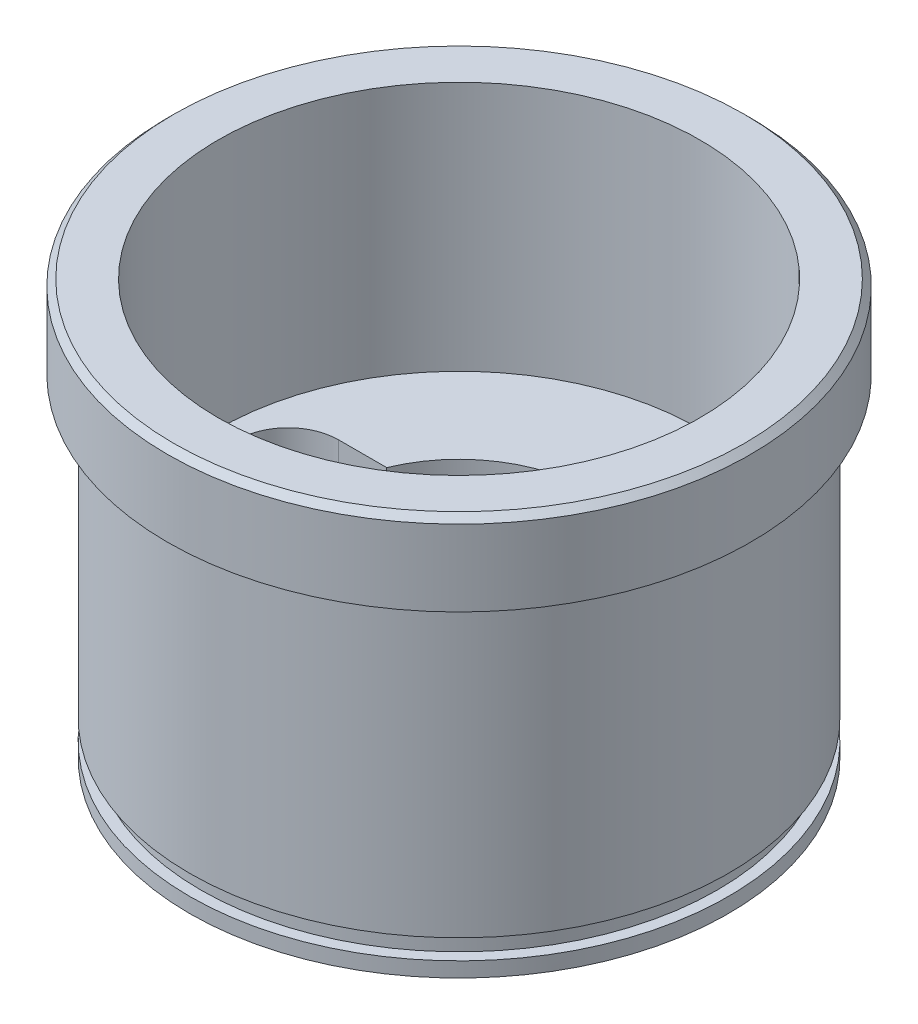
ISO-10303-21;
HEADER;
FILE_DESCRIPTION(('STEP AP214'),'2;1');
FILE_NAME('part.step','',(''),(''),'','','');
FILE_SCHEMA(('AUTOMOTIVE_DESIGN { 1 0 10303 214 1 1 1 1 }'));
ENDSEC;
DATA;
#1=APPLICATION_CONTEXT('core data for automotive mechanical design processes');
#2=APPLICATION_PROTOCOL_DEFINITION('international standard','automotive_design',2000,#1);
#3=PRODUCT_CONTEXT('',#1,'mechanical');
#4=PRODUCT('Part','Part','',(#3));
#5=PRODUCT_RELATED_PRODUCT_CATEGORY('part','',(#4));
#6=PRODUCT_DEFINITION_FORMATION('','',#4);
#7=PRODUCT_DEFINITION_CONTEXT('part definition',#1,'design');
#8=PRODUCT_DEFINITION('design','',#6,#7);
#9=PRODUCT_DEFINITION_SHAPE('','',#8);
#10=(LENGTH_UNIT() NAMED_UNIT(*) SI_UNIT(.MILLI.,.METRE.));
#11=(NAMED_UNIT(*) PLANE_ANGLE_UNIT() SI_UNIT($,.RADIAN.));
#12=(NAMED_UNIT(*) SI_UNIT($,.STERADIAN.) SOLID_ANGLE_UNIT());
#13=UNCERTAINTY_MEASURE_WITH_UNIT(LENGTH_MEASURE(1.E-05),#10,'distance_accuracy_value','');
#14=(GEOMETRIC_REPRESENTATION_CONTEXT(3) GLOBAL_UNCERTAINTY_ASSIGNED_CONTEXT((#13)) GLOBAL_UNIT_ASSIGNED_CONTEXT((#10,
#11,#12)) REPRESENTATION_CONTEXT('',''));
#15=CARTESIAN_POINT('',(0.,0.,0.));
#16=DIRECTION('',(0.,0.,1.));
#17=DIRECTION('',(1.,0.,0.));
#18=AXIS2_PLACEMENT_3D('',#15,#16,#17);
#19=CARTESIAN_POINT('',(0.,0.,0.));
#20=DIRECTION('',(0.,1.,0.));
#21=DIRECTION('',(0.,0.,1.));
#22=AXIS2_PLACEMENT_3D('',#19,#20,#21);
#23=CYLINDRICAL_SURFACE('',#22,42.5);
#24=CARTESIAN_POINT('',(0.,2.35000000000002,0.));
#25=DIRECTION('',(0.,-1.,0.));
#26=DIRECTION('',(0.,0.,-1.));
#27=AXIS2_PLACEMENT_3D('',#24,#25,#26);
#28=CIRCLE('',#27,42.5);
#29=CARTESIAN_POINT('',(0.,2.35000000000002,-42.5));
#30=VERTEX_POINT('',#29);
#31=EDGE_CURVE('E210',#30,#30,#28,.F.);
#32=ORIENTED_EDGE('',*,*,#31,.F.);
#33=EDGE_LOOP('',(#32));
#34=FACE_BOUND('',#33,.T.);
#35=CARTESIAN_POINT('',(0.,0.,0.));
#36=DIRECTION('',(0.,1.,0.));
#37=DIRECTION('',(0.,0.,1.));
#38=AXIS2_PLACEMENT_3D('',#35,#36,#37);
#39=CIRCLE('',#38,42.5);
#40=CARTESIAN_POINT('',(0.,0.,42.5));
#41=VERTEX_POINT('',#40);
#42=EDGE_CURVE('E223',#41,#41,#39,.T.);
#43=ORIENTED_EDGE('',*,*,#42,.T.);
#44=EDGE_LOOP('',(#43));
#45=FACE_BOUND('',#44,.T.);
#46=ADVANCED_FACE('F34',(#34,#45),#23,.T.);
#47=CARTESIAN_POINT('',(0.,0.,0.));
#48=DIRECTION('',(0.,1.,0.));
#49=DIRECTION('',(0.,0.,1.));
#50=AXIS2_PLACEMENT_3D('',#47,#48,#49);
#51=CYLINDRICAL_SURFACE('',#50,33.);
#52=CARTESIAN_POINT('',(0.,1.5,0.));
#53=DIRECTION('',(0.,-1.,0.));
#54=DIRECTION('',(0.,0.,-1.));
#55=AXIS2_PLACEMENT_3D('',#52,#53,#54);
#56=CIRCLE('',#55,33.);
#57=CARTESIAN_POINT('',(0.,1.5,-33.));
#58=VERTEX_POINT('',#57);
#59=EDGE_CURVE('E258',#58,#58,#56,.T.);
#60=ORIENTED_EDGE('',*,*,#59,.T.);
#61=EDGE_LOOP('',(#60));
#62=FACE_BOUND('',#61,.T.);
#63=CARTESIAN_POINT('',(0.,5.,0.));
#64=DIRECTION('',(0.,1.,0.));
#65=DIRECTION('',(0.,0.,1.));
#66=AXIS2_PLACEMENT_3D('',#63,#64,#65);
#67=CIRCLE('',#66,33.);
#68=CARTESIAN_POINT('',(0.,5.,33.));
#69=VERTEX_POINT('',#68);
#70=EDGE_CURVE('E224',#69,#69,#67,.T.);
#71=ORIENTED_EDGE('',*,*,#70,.T.);
#72=EDGE_LOOP('',(#71));
#73=FACE_BOUND('',#72,.T.);
#74=ADVANCED_FACE('F318',(#62,#73),#51,.F.);
#75=CARTESIAN_POINT('',(0.,14.,0.));
#76=DIRECTION('',(0.,1.,0.));
#77=DIRECTION('',(0.,0.,1.));
#78=AXIS2_PLACEMENT_3D('',#75,#76,#77);
#79=CIRCLE('',#78,33.);
#80=CARTESIAN_POINT('',(0.,14.,33.));
#81=VERTEX_POINT('',#80);
#82=EDGE_CURVE('E227',#81,#81,#79,.T.);
#83=ORIENTED_EDGE('',*,*,#82,.T.);
#84=EDGE_LOOP('',(#83));
#85=FACE_BOUND('',#84,.T.);
#86=CARTESIAN_POINT('',(0.,9.77,0.));
#87=DIRECTION('',(0.,-1.,0.));
#88=DIRECTION('',(0.,0.,-1.));
#89=AXIS2_PLACEMENT_3D('',#86,#87,#88);
#90=CIRCLE('',#89,33.);
#91=CARTESIAN_POINT('',(0.,9.77,-33.));
#92=VERTEX_POINT('',#91);
#93=EDGE_CURVE('E219',#92,#92,#90,.T.);
#94=ORIENTED_EDGE('',*,*,#93,.T.);
#95=EDGE_LOOP('',(#94));
#96=FACE_BOUND('',#95,.T.);
#97=ADVANCED_FACE('F325',(#85,#96),#51,.F.);
#98=CARTESIAN_POINT('',(-46.,52.5,0.));
#99=DIRECTION('',(0.,-1.,0.));
#100=DIRECTION('',(0.,0.,-1.));
#101=AXIS2_PLACEMENT_3D('',#98,#99,#100);
#102=PLANE('',#101);
#103=CARTESIAN_POINT('',(0.,52.5,0.));
#104=DIRECTION('',(0.,1.,0.));
#105=DIRECTION('',(0.,0.,1.));
#106=AXIS2_PLACEMENT_3D('',#103,#104,#105);
#107=CIRCLE('',#106,42.5);
#108=CARTESIAN_POINT('',(0.,52.5,42.5));
#109=VERTEX_POINT('',#108);
#110=EDGE_CURVE('E220',#109,#109,#107,.T.);
#111=ORIENTED_EDGE('',*,*,#110,.T.);
#112=EDGE_LOOP('',(#111));
#113=FACE_BOUND('',#112,.T.);
#114=CARTESIAN_POINT('',(0.,52.5,0.));
#115=DIRECTION('',(0.,1.,0.));
#116=DIRECTION('',(0.,0.,1.));
#117=AXIS2_PLACEMENT_3D('',#114,#115,#116);
#118=CIRCLE('',#117,46.);
#119=CARTESIAN_POINT('',(0.,52.5,46.));
#120=VERTEX_POINT('',#119);
#121=EDGE_CURVE('E240',#120,#120,#118,.T.);
#122=ORIENTED_EDGE('',*,*,#121,.F.);
#123=EDGE_LOOP('',(#122));
#124=FACE_BOUND('',#123,.T.);
#125=ADVANCED_FACE('F36',(#113,#124),#102,.T.);
#126=CARTESIAN_POINT('',(0.,0.,0.));
#127=DIRECTION('',(0.,1.,0.));
#128=DIRECTION('',(0.,0.,1.));
#129=AXIS2_PLACEMENT_3D('',#126,#127,#128);
#130=CYLINDRICAL_SURFACE('',#129,46.);
#131=CARTESIAN_POINT('',(0.,64.5,0.));
#132=DIRECTION('',(0.,1.,0.));
#133=DIRECTION('',(0.,0.,1.));
#134=AXIS2_PLACEMENT_3D('',#131,#132,#133);
#135=CIRCLE('',#134,46.);
#136=CARTESIAN_POINT('',(0.,64.5,46.));
#137=VERTEX_POINT('',#136);
#138=EDGE_CURVE('E246',#137,#137,#135,.F.);
#139=ORIENTED_EDGE('',*,*,#138,.T.);
#140=EDGE_LOOP('',(#139));
#141=FACE_BOUND('',#140,.T.);
#142=ORIENTED_EDGE('',*,*,#121,.T.);
#143=EDGE_LOOP('',(#142));
#144=FACE_BOUND('',#143,.T.);
#145=ADVANCED_FACE('F350',(#141,#144),#130,.T.);
#146=CARTESIAN_POINT('',(-38.,65.5,0.));
#147=DIRECTION('',(0.,1.,0.));
#148=DIRECTION('',(0.,0.,1.));
#149=AXIS2_PLACEMENT_3D('',#146,#147,#148);
#150=PLANE('',#149);
#151=CARTESIAN_POINT('',(0.,65.5,0.));
#152=DIRECTION('',(0.,1.,0.));
#153=DIRECTION('',(0.,0.,1.));
#154=AXIS2_PLACEMENT_3D('',#151,#152,#153);
#155=CIRCLE('',#154,45.);
#156=CARTESIAN_POINT('',(0.,65.5,45.));
#157=VERTEX_POINT('',#156);
#158=EDGE_CURVE('E243',#157,#157,#155,.T.);
#159=ORIENTED_EDGE('',*,*,#158,.T.);
#160=EDGE_LOOP('',(#159));
#161=FACE_BOUND('',#160,.T.);
#162=CARTESIAN_POINT('',(0.,65.5,0.));
#163=DIRECTION('',(0.,1.,0.));
#164=DIRECTION('',(0.,0.,1.));
#165=AXIS2_PLACEMENT_3D('',#162,#163,#164);
#166=CIRCLE('',#165,38.);
#167=CARTESIAN_POINT('',(0.,65.5,38.));
#168=VERTEX_POINT('',#167);
#169=EDGE_CURVE('E237',#168,#168,#166,.T.);
#170=ORIENTED_EDGE('',*,*,#169,.F.);
#171=EDGE_LOOP('',(#170));
#172=FACE_BOUND('',#171,.T.);
#173=ADVANCED_FACE('F354',(#161,#172),#150,.T.);
#174=CARTESIAN_POINT('',(0.,0.,0.));
#175=DIRECTION('',(0.,1.,0.));
#176=DIRECTION('',(0.,0.,1.));
#177=AXIS2_PLACEMENT_3D('',#174,#175,#176);
#178=CYLINDRICAL_SURFACE('',#177,38.);
#179=ORIENTED_EDGE('',*,*,#169,.T.);
#180=EDGE_LOOP('',(#179));
#181=FACE_BOUND('',#180,.T.);
#182=CARTESIAN_POINT('',(0.,26.,0.));
#183=DIRECTION('',(0.,1.,0.));
#184=DIRECTION('',(0.,0.,1.));
#185=AXIS2_PLACEMENT_3D('',#182,#183,#184);
#186=CIRCLE('',#185,38.);
#187=CARTESIAN_POINT('',(0.,26.,38.));
#188=VERTEX_POINT('',#187);
#189=EDGE_CURVE('E233',#188,#188,#186,.T.);
#190=ORIENTED_EDGE('',*,*,#189,.F.);
#191=EDGE_LOOP('',(#190));
#192=FACE_BOUND('',#191,.T.);
#193=ADVANCED_FACE('F359',(#181,#192),#178,.F.);
#194=CARTESIAN_POINT('',(-21.,26.,0.));
#195=DIRECTION('',(0.,1.,0.));
#196=DIRECTION('',(0.,0.,1.));
#197=AXIS2_PLACEMENT_3D('',#194,#195,#196);
#198=PLANE('',#197);
#199=DIRECTION('',(0.500000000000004,0.,0.866025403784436));
#200=VECTOR('',#199,1.);
#201=CARTESIAN_POINT('',(6.57179676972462,26.,27.3826859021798));
#202=LINE('',#201,#200);
#203=CARTESIAN_POINT('',(2.78004068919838,26.,20.8151717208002));
#204=VERTEX_POINT('',#203);
#205=CARTESIAN_POINT('',(6.57179676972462,26.,27.3826859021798));
#206=VERTEX_POINT('',#205);
#207=EDGE_CURVE('E162',#204,#206,#202,.T.);
#208=ORIENTED_EDGE('',*,*,#207,.F.);
#209=CARTESIAN_POINT('',(0.,26.,0.));
#210=DIRECTION('',(0.,1.,0.));
#211=DIRECTION('',(0.,0.,1.));
#212=AXIS2_PLACEMENT_3D('',#209,#210,#211);
#213=CIRCLE('',#212,21.);
#214=CARTESIAN_POINT('',(-19.4164878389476,26.,8.));
#215=VERTEX_POINT('',#214);
#216=EDGE_CURVE('E230',#215,#204,#213,.T.);
#217=ORIENTED_EDGE('',*,*,#216,.F.);
#218=DIRECTION('',(1.,0.,0.));
#219=VECTOR('',#218,1.);
#220=CARTESIAN_POINT('',(-27.,26.,8.));
#221=LINE('',#220,#219);
#222=CARTESIAN_POINT('',(-27.,26.,8.));
#223=VERTEX_POINT('',#222);
#224=EDGE_CURVE('E183',#223,#215,#221,.T.);
#225=ORIENTED_EDGE('',*,*,#224,.F.);
#226=CARTESIAN_POINT('',(-27.,26.,0.));
#227=DIRECTION('',(0.,1.,0.));
#228=DIRECTION('',(0.,0.,1.));
#229=AXIS2_PLACEMENT_3D('',#226,#227,#228);
#230=CIRCLE('',#229,8.);
#231=CARTESIAN_POINT('',(-27.,26.,-8.));
#232=VERTEX_POINT('',#231);
#233=EDGE_CURVE('E178',#232,#223,#230,.T.);
#234=ORIENTED_EDGE('',*,*,#233,.F.);
#235=DIRECTION('',(-1.,0.,0.));
#236=VECTOR('',#235,1.);
#237=CARTESIAN_POINT('',(-27.,26.,-8.));
#238=LINE('',#237,#236);
#239=CARTESIAN_POINT('',(-19.4164878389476,26.,-8.));
#240=VERTEX_POINT('',#239);
#241=EDGE_CURVE('E185',#240,#232,#238,.T.);
#242=ORIENTED_EDGE('',*,*,#241,.F.);
#243=CARTESIAN_POINT('',(2.7800406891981,26.,-20.8151717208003));
#244=VERTEX_POINT('',#243);
#245=EDGE_CURVE('E146',#244,#240,#213,.T.);
#246=ORIENTED_EDGE('',*,*,#245,.F.);
#247=DIRECTION('',(-0.499999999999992,0.,0.866025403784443));
#248=VECTOR('',#247,1.);
#249=CARTESIAN_POINT('',(6.57179676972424,26.,-27.3826859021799));
#250=LINE('',#249,#248);
#251=CARTESIAN_POINT('',(6.57179676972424,26.,-27.3826859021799));
#252=VERTEX_POINT('',#251);
#253=EDGE_CURVE('E57',#252,#244,#250,.T.);
#254=ORIENTED_EDGE('',*,*,#253,.F.);
#255=CARTESIAN_POINT('',(13.4999999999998,26.,-23.38268590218));
#256=DIRECTION('',(0.,1.,0.));
#257=DIRECTION('',(-0.866025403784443,0.,-0.499999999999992));
#258=AXIS2_PLACEMENT_3D('',#255,#256,#257);
#259=CIRCLE('',#258,8.);
#260=CARTESIAN_POINT('',(20.4282032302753,26.,-19.38268590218));
#261=VERTEX_POINT('',#260);
#262=EDGE_CURVE('E134',#261,#252,#259,.T.);
#263=ORIENTED_EDGE('',*,*,#262,.F.);
#264=DIRECTION('',(0.499999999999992,0.,-0.866025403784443));
#265=VECTOR('',#264,1.);
#266=CARTESIAN_POINT('',(20.4282032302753,26.,-19.38268590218));
#267=LINE('',#266,#265);
#268=CARTESIAN_POINT('',(16.6364471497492,26.,-12.8151717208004));
#269=VERTEX_POINT('',#268);
#270=EDGE_CURVE('E147',#269,#261,#267,.T.);
#271=ORIENTED_EDGE('',*,*,#270,.F.);
#272=CARTESIAN_POINT('',(16.6364471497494,26.,12.8151717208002));
#273=VERTEX_POINT('',#272);
#274=EDGE_CURVE('E234',#273,#269,#213,.T.);
#275=ORIENTED_EDGE('',*,*,#274,.F.);
#276=DIRECTION('',(-0.500000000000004,0.,-0.866025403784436));
#277=VECTOR('',#276,1.);
#278=CARTESIAN_POINT('',(20.4282032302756,26.,19.3826859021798));
#279=LINE('',#278,#277);
#280=CARTESIAN_POINT('',(20.4282032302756,26.,19.3826859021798));
#281=VERTEX_POINT('',#280);
#282=EDGE_CURVE('E160',#281,#273,#279,.T.);
#283=ORIENTED_EDGE('',*,*,#282,.F.);
#284=CARTESIAN_POINT('',(13.5000000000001,26.,23.3826859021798));
#285=DIRECTION('',(0.,1.,0.));
#286=DIRECTION('',(0.866025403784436,0.,-0.500000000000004));
#287=AXIS2_PLACEMENT_3D('',#284,#285,#286);
#288=CIRCLE('',#287,8.);
#289=EDGE_CURVE('E156',#206,#281,#288,.T.);
#290=ORIENTED_EDGE('',*,*,#289,.F.);
#291=EDGE_LOOP('',(#208,#217,#225,#234,#242,#246,#254,#263,#271,#275,#283,#290));
#292=FACE_BOUND('',#291,.T.);
#293=ORIENTED_EDGE('',*,*,#189,.T.);
#294=EDGE_LOOP('',(#293));
#295=FACE_BOUND('',#294,.T.);
#296=ADVANCED_FACE('F143',(#292,#295),#198,.T.);
#297=CARTESIAN_POINT('',(0.,0.,0.));
#298=DIRECTION('',(0.,1.,0.));
#299=DIRECTION('',(0.,0.,1.));
#300=AXIS2_PLACEMENT_3D('',#297,#298,#299);
#301=CYLINDRICAL_SURFACE('',#300,21.);
#302=DIRECTION('',(0.,1.,0.));
#303=VECTOR('',#302,1.);
#304=CARTESIAN_POINT('',(2.78004068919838,0.,20.8151717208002));
#305=LINE('',#304,#303);
#306=CARTESIAN_POINT('',(2.78004068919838,19.,20.8151717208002));
#307=VERTEX_POINT('',#306);
#308=EDGE_CURVE('E11',#307,#204,#305,.T.);
#309=ORIENTED_EDGE('',*,*,#308,.F.);
#310=CARTESIAN_POINT('',(0.,19.,0.));
#311=DIRECTION('',(0.,1.,0.));
#312=DIRECTION('',(0.,0.,1.));
#313=AXIS2_PLACEMENT_3D('',#310,#311,#312);
#314=CIRCLE('',#313,21.);
#315=CARTESIAN_POINT('',(16.6364471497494,19.,12.8151717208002));
#316=VERTEX_POINT('',#315);
#317=EDGE_CURVE('E284',#307,#316,#314,.T.);
#318=ORIENTED_EDGE('',*,*,#317,.T.);
#319=DIRECTION('',(0.,1.,0.));
#320=VECTOR('',#319,1.);
#321=CARTESIAN_POINT('',(16.6364471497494,0.,12.8151717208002));
#322=LINE('',#321,#320);
#323=EDGE_CURVE('E42',#273,#316,#322,.F.);
#324=ORIENTED_EDGE('',*,*,#323,.F.);
#325=ORIENTED_EDGE('',*,*,#274,.T.);
#326=DIRECTION('',(0.,1.,0.));
#327=VECTOR('',#326,1.);
#328=CARTESIAN_POINT('',(16.6364471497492,0.,-12.8151717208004));
#329=LINE('',#328,#327);
#330=CARTESIAN_POINT('',(16.6364471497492,19.,-12.8151717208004));
#331=VERTEX_POINT('',#330);
#332=EDGE_CURVE('E283',#331,#269,#329,.T.);
#333=ORIENTED_EDGE('',*,*,#332,.F.);
#334=CARTESIAN_POINT('',(2.7800406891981,19.,-20.8151717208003));
#335=VERTEX_POINT('',#334);
#336=EDGE_CURVE('E280',#331,#335,#314,.T.);
#337=ORIENTED_EDGE('',*,*,#336,.T.);
#338=DIRECTION('',(0.,1.,0.));
#339=VECTOR('',#338,1.);
#340=CARTESIAN_POINT('',(2.7800406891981,0.,-20.8151717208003));
#341=LINE('',#340,#339);
#342=EDGE_CURVE('E278',#244,#335,#341,.F.);
#343=ORIENTED_EDGE('',*,*,#342,.F.);
#344=ORIENTED_EDGE('',*,*,#245,.T.);
#345=DIRECTION('',(0.,1.,0.));
#346=VECTOR('',#345,1.);
#347=CARTESIAN_POINT('',(-19.4164878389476,0.,-8.));
#348=LINE('',#347,#346);
#349=CARTESIAN_POINT('',(-19.4164878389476,19.,-8.));
#350=VERTEX_POINT('',#349);
#351=EDGE_CURVE('E275',#350,#240,#348,.T.);
#352=ORIENTED_EDGE('',*,*,#351,.F.);
#353=CARTESIAN_POINT('',(0.,19.,0.));
#354=DIRECTION('',(0.,1.,0.));
#355=DIRECTION('',(0.,0.,1.));
#356=AXIS2_PLACEMENT_3D('',#353,#354,#355);
#357=CIRCLE('',#356,21.);
#358=CARTESIAN_POINT('',(-19.4164878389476,19.,8.));
#359=VERTEX_POINT('',#358);
#360=EDGE_CURVE('E261',#350,#359,#357,.T.);
#361=ORIENTED_EDGE('',*,*,#360,.T.);
#362=DIRECTION('',(0.,1.,0.));
#363=VECTOR('',#362,1.);
#364=CARTESIAN_POINT('',(-19.4164878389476,0.,8.));
#365=LINE('',#364,#363);
#366=EDGE_CURVE('E272',#215,#359,#365,.F.);
#367=ORIENTED_EDGE('',*,*,#366,.F.);
#368=ORIENTED_EDGE('',*,*,#216,.T.);
#369=EDGE_LOOP('',(#309,#318,#324,#325,#333,#337,#343,#344,#352,#361,#367,#368));
#370=FACE_BOUND('',#369,.T.);
#371=CARTESIAN_POINT('',(0.,15.,0.));
#372=DIRECTION('',(0.,-1.,0.));
#373=DIRECTION('',(0.,0.,-1.));
#374=AXIS2_PLACEMENT_3D('',#371,#372,#373);
#375=CIRCLE('',#374,21.);
#376=CARTESIAN_POINT('',(0.,15.,-21.));
#377=VERTEX_POINT('',#376);
#378=EDGE_CURVE('E252',#377,#377,#375,.T.);
#379=ORIENTED_EDGE('',*,*,#378,.T.);
#380=EDGE_LOOP('',(#379));
#381=FACE_BOUND('',#380,.T.);
#382=ADVANCED_FACE('F290',(#370,#381),#301,.F.);
#383=CARTESIAN_POINT('',(-33.,14.,0.));
#384=DIRECTION('',(0.,-1.,0.));
#385=DIRECTION('',(0.,0.,-1.));
#386=AXIS2_PLACEMENT_3D('',#383,#384,#385);
#387=PLANE('',#386);
#388=CARTESIAN_POINT('',(13.4999999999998,14.,-23.38268590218));
#389=DIRECTION('',(0.,-1.,0.));
#390=DIRECTION('',(0.,0.,-1.));
#391=AXIS2_PLACEMENT_3D('',#388,#389,#390);
#392=CIRCLE('',#391,3.5);
#393=CARTESIAN_POINT('',(13.4999999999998,14.,-26.88268590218));
#394=VERTEX_POINT('',#393);
#395=EDGE_CURVE('E377',#394,#394,#392,.F.);
#396=ORIENTED_EDGE('',*,*,#395,.T.);
#397=EDGE_LOOP('',(#396));
#398=FACE_BOUND('',#397,.T.);
#399=CARTESIAN_POINT('',(13.5000000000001,14.,23.3826859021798));
#400=DIRECTION('',(0.,-1.,0.));
#401=DIRECTION('',(0.,0.,-1.));
#402=AXIS2_PLACEMENT_3D('',#399,#400,#401);
#403=CIRCLE('',#402,3.5);
#404=CARTESIAN_POINT('',(13.5000000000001,14.,19.8826859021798));
#405=VERTEX_POINT('',#404);
#406=EDGE_CURVE('E381',#405,#405,#403,.F.);
#407=ORIENTED_EDGE('',*,*,#406,.T.);
#408=EDGE_LOOP('',(#407));
#409=FACE_BOUND('',#408,.T.);
#410=CARTESIAN_POINT('',(-27.,14.,0.));
#411=DIRECTION('',(0.,-1.,0.));
#412=DIRECTION('',(0.,0.,-1.));
#413=AXIS2_PLACEMENT_3D('',#410,#411,#412);
#414=CIRCLE('',#413,3.5);
#415=CARTESIAN_POINT('',(-27.,14.,-3.5));
#416=VERTEX_POINT('',#415);
#417=EDGE_CURVE('E173',#416,#416,#414,.F.);
#418=ORIENTED_EDGE('',*,*,#417,.T.);
#419=EDGE_LOOP('',(#418));
#420=FACE_BOUND('',#419,.T.);
#421=CARTESIAN_POINT('',(0.,14.,0.));
#422=DIRECTION('',(0.,-1.,0.));
#423=DIRECTION('',(0.,0.,-1.));
#424=AXIS2_PLACEMENT_3D('',#421,#422,#423);
#425=CIRCLE('',#424,22.);
#426=CARTESIAN_POINT('',(0.,14.,-22.));
#427=VERTEX_POINT('',#426);
#428=EDGE_CURVE('E249',#427,#427,#425,.F.);
#429=ORIENTED_EDGE('',*,*,#428,.T.);
#430=EDGE_LOOP('',(#429));
#431=FACE_BOUND('',#430,.T.);
#432=ORIENTED_EDGE('',*,*,#82,.F.);
#433=EDGE_LOOP('',(#432));
#434=FACE_BOUND('',#433,.T.);
#435=ADVANCED_FACE('F342',(#398,#409,#420,#431,#434),#387,.T.);
#436=CARTESIAN_POINT('',(-42.5,0.,0.));
#437=DIRECTION('',(0.,-1.,0.));
#438=DIRECTION('',(0.,0.,-1.));
#439=AXIS2_PLACEMENT_3D('',#436,#437,#438);
#440=PLANE('',#439);
#441=CARTESIAN_POINT('',(0.,0.,0.));
#442=DIRECTION('',(0.,-1.,0.));
#443=DIRECTION('',(0.,0.,-1.));
#444=AXIS2_PLACEMENT_3D('',#441,#442,#443);
#445=CIRCLE('',#444,33.8660254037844);
#446=CARTESIAN_POINT('',(0.,0.,-33.8660254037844));
#447=VERTEX_POINT('',#446);
#448=EDGE_CURVE('E255',#447,#447,#445,.F.);
#449=ORIENTED_EDGE('',*,*,#448,.T.);
#450=EDGE_LOOP('',(#449));
#451=FACE_BOUND('',#450,.T.);
#452=ORIENTED_EDGE('',*,*,#42,.F.);
#453=EDGE_LOOP('',(#452));
#454=FACE_BOUND('',#453,.T.);
#455=ADVANCED_FACE('F334',(#451,#454),#440,.T.);
#456=CARTESIAN_POINT('',(0.,5.50000000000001,0.));
#457=DIRECTION('',(0.,1.,0.));
#458=DIRECTION('',(0.,0.,1.));
#459=AXIS2_PLACEMENT_3D('',#456,#457,#458);
#460=CIRCLE('',#459,42.5);
#461=CARTESIAN_POINT('',(0.,5.50000000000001,42.5));
#462=VERTEX_POINT('',#461);
#463=EDGE_CURVE('E205',#462,#462,#460,.F.);
#464=ORIENTED_EDGE('',*,*,#463,.F.);
#465=EDGE_LOOP('',(#464));
#466=FACE_BOUND('',#465,.T.);
#467=ORIENTED_EDGE('',*,*,#110,.F.);
#468=EDGE_LOOP('',(#467));
#469=FACE_BOUND('',#468,.T.);
#470=ADVANCED_FACE('F321',(#466,#469),#23,.T.);
#471=CARTESIAN_POINT('',(0.,65.5,0.));
#472=DIRECTION('',(0.,-1.,0.));
#473=DIRECTION('',(0.,0.,-1.));
#474=AXIS2_PLACEMENT_3D('',#471,#472,#473);
#475=CONICAL_SURFACE('',#474,45.,0.785398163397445);
#476=ORIENTED_EDGE('',*,*,#138,.F.);
#477=EDGE_LOOP('',(#476));
#478=FACE_BOUND('',#477,.T.);
#479=ORIENTED_EDGE('',*,*,#158,.F.);
#480=EDGE_LOOP('',(#479));
#481=FACE_BOUND('',#480,.T.);
#482=ADVANCED_FACE('F333',(#478,#481),#475,.T.);
#483=CARTESIAN_POINT('',(0.,14.,0.));
#484=DIRECTION('',(0.,-1.,0.));
#485=DIRECTION('',(0.,0.,-1.));
#486=AXIS2_PLACEMENT_3D('',#483,#484,#485);
#487=CONICAL_SURFACE('',#486,22.,0.785398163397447);
#488=ORIENTED_EDGE('',*,*,#378,.F.);
#489=EDGE_LOOP('',(#488));
#490=FACE_BOUND('',#489,.T.);
#491=ORIENTED_EDGE('',*,*,#428,.F.);
#492=EDGE_LOOP('',(#491));
#493=FACE_BOUND('',#492,.T.);
#494=ADVANCED_FACE('F340',(#490,#493),#487,.F.);
#495=CARTESIAN_POINT('',(0.,0.,0.));
#496=DIRECTION('',(0.,-1.,0.));
#497=DIRECTION('',(0.,0.,-1.));
#498=AXIS2_PLACEMENT_3D('',#495,#496,#497);
#499=CONICAL_SURFACE('',#498,33.8660254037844,0.523598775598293);
#500=ORIENTED_EDGE('',*,*,#59,.F.);
#501=EDGE_LOOP('',(#500));
#502=FACE_BOUND('',#501,.T.);
#503=ORIENTED_EDGE('',*,*,#448,.F.);
#504=EDGE_LOOP('',(#503));
#505=FACE_BOUND('',#504,.T.);
#506=ADVANCED_FACE('F418',(#502,#505),#499,.F.);
#507=CARTESIAN_POINT('',(-34.86,5.,0.));
#508=DIRECTION('',(0.,1.,0.));
#509=DIRECTION('',(0.,0.,1.));
#510=AXIS2_PLACEMENT_3D('',#507,#508,#509);
#511=PLANE('',#510);
#512=ORIENTED_EDGE('',*,*,#70,.F.);
#513=EDGE_LOOP('',(#512));
#514=FACE_BOUND('',#513,.T.);
#515=CARTESIAN_POINT('',(0.,5.,0.));
#516=DIRECTION('',(0.,-1.,0.));
#517=DIRECTION('',(0.,0.,-1.));
#518=AXIS2_PLACEMENT_3D('',#515,#516,#517);
#519=CIRCLE('',#518,34.86);
#520=CARTESIAN_POINT('',(0.,5.,-34.86));
#521=VERTEX_POINT('',#520);
#522=EDGE_CURVE('E216',#521,#521,#519,.T.);
#523=ORIENTED_EDGE('',*,*,#522,.F.);
#524=EDGE_LOOP('',(#523));
#525=FACE_BOUND('',#524,.T.);
#526=ADVANCED_FACE('F414',(#514,#525),#511,.T.);
#527=CARTESIAN_POINT('',(0.,6.00000000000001,0.));
#528=DIRECTION('',(0.,-1.,0.));
#529=DIRECTION('',(0.,0.,-1.));
#530=AXIS2_PLACEMENT_3D('',#527,#528,#529);
#531=TOROIDAL_SURFACE('',#530,34.86,1.);
#532=ORIENTED_EDGE('',*,*,#522,.T.);
#533=EDGE_LOOP('',(#532));
#534=FACE_BOUND('',#533,.T.);
#535=CARTESIAN_POINT('',(0.,6.00000000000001,0.));
#536=DIRECTION('',(0.,-1.,0.));
#537=DIRECTION('',(0.,0.,-1.));
#538=AXIS2_PLACEMENT_3D('',#535,#536,#537);
#539=CIRCLE('',#538,35.86);
#540=CARTESIAN_POINT('',(0.,6.00000000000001,-35.86));
#541=VERTEX_POINT('',#540);
#542=EDGE_CURVE('E213',#541,#541,#539,.T.);
#543=ORIENTED_EDGE('',*,*,#542,.F.);
#544=EDGE_LOOP('',(#543));
#545=FACE_BOUND('',#544,.T.);
#546=ADVANCED_FACE('F407',(#534,#545),#531,.F.);
#547=CARTESIAN_POINT('',(0.,0.,0.));
#548=DIRECTION('',(0.,-1.,0.));
#549=DIRECTION('',(0.,0.,-1.));
#550=AXIS2_PLACEMENT_3D('',#547,#548,#549);
#551=CYLINDRICAL_SURFACE('',#550,35.86);
#552=ORIENTED_EDGE('',*,*,#542,.T.);
#553=EDGE_LOOP('',(#552));
#554=FACE_BOUND('',#553,.T.);
#555=CARTESIAN_POINT('',(0.,8.77,0.));
#556=DIRECTION('',(0.,-1.,0.));
#557=DIRECTION('',(0.,0.,-1.));
#558=AXIS2_PLACEMENT_3D('',#555,#556,#557);
#559=CIRCLE('',#558,35.86);
#560=CARTESIAN_POINT('',(0.,8.77,-35.86));
#561=VERTEX_POINT('',#560);
#562=EDGE_CURVE('E209',#561,#561,#559,.T.);
#563=ORIENTED_EDGE('',*,*,#562,.F.);
#564=EDGE_LOOP('',(#563));
#565=FACE_BOUND('',#564,.T.);
#566=ADVANCED_FACE('F401',(#554,#565),#551,.F.);
#567=CARTESIAN_POINT('',(0.,8.77,0.));
#568=DIRECTION('',(0.,-1.,0.));
#569=DIRECTION('',(0.,0.,-1.));
#570=AXIS2_PLACEMENT_3D('',#567,#568,#569);
#571=TOROIDAL_SURFACE('',#570,34.86,1.);
#572=ORIENTED_EDGE('',*,*,#562,.T.);
#573=EDGE_LOOP('',(#572));
#574=FACE_BOUND('',#573,.T.);
#575=CARTESIAN_POINT('',(0.,9.77,0.));
#576=DIRECTION('',(0.,-1.,0.));
#577=DIRECTION('',(0.,0.,-1.));
#578=AXIS2_PLACEMENT_3D('',#575,#576,#577);
#579=CIRCLE('',#578,34.86);
#580=CARTESIAN_POINT('',(0.,9.77,-34.86));
#581=VERTEX_POINT('',#580);
#582=EDGE_CURVE('E206',#581,#581,#579,.T.);
#583=ORIENTED_EDGE('',*,*,#582,.F.);
#584=EDGE_LOOP('',(#583));
#585=FACE_BOUND('',#584,.T.);
#586=ADVANCED_FACE('F396',(#574,#585),#571,.F.);
#587=CARTESIAN_POINT('',(-34.86,9.77,0.));
#588=DIRECTION('',(0.,-1.,0.));
#589=DIRECTION('',(0.,0.,-1.));
#590=AXIS2_PLACEMENT_3D('',#587,#588,#589);
#591=PLANE('',#590);
#592=ORIENTED_EDGE('',*,*,#93,.F.);
#593=EDGE_LOOP('',(#592));
#594=FACE_BOUND('',#593,.T.);
#595=ORIENTED_EDGE('',*,*,#582,.T.);
#596=EDGE_LOOP('',(#595));
#597=FACE_BOUND('',#596,.T.);
#598=ADVANCED_FACE('F392',(#594,#597),#591,.T.);
#599=CARTESIAN_POINT('',(-53.4212962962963,2.35000000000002,0.));
#600=DIRECTION('',(0.,-1.,0.));
#601=DIRECTION('',(0.,0.,-1.));
#602=AXIS2_PLACEMENT_3D('',#599,#600,#601);
#603=PLANE('',#602);
#604=ORIENTED_EDGE('',*,*,#31,.T.);
#605=EDGE_LOOP('',(#604));
#606=FACE_BOUND('',#605,.T.);
#607=CARTESIAN_POINT('',(0.,2.35000000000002,0.));
#608=DIRECTION('',(0.,1.,0.));
#609=DIRECTION('',(0.,0.,1.));
#610=AXIS2_PLACEMENT_3D('',#607,#608,#609);
#611=CIRCLE('',#610,40.75);
#612=CARTESIAN_POINT('',(0.,2.35000000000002,40.75));
#613=VERTEX_POINT('',#612);
#614=EDGE_CURVE('E202',#613,#613,#611,.T.);
#615=ORIENTED_EDGE('',*,*,#614,.F.);
#616=EDGE_LOOP('',(#615));
#617=FACE_BOUND('',#616,.T.);
#618=ADVANCED_FACE('F395',(#606,#617),#603,.F.);
#619=CARTESIAN_POINT('',(0.,0.,0.));
#620=DIRECTION('',(0.,1.,0.));
#621=DIRECTION('',(0.,0.,1.));
#622=AXIS2_PLACEMENT_3D('',#619,#620,#621);
#623=CYLINDRICAL_SURFACE('',#622,40.75);
#624=CARTESIAN_POINT('',(0.,5.50000000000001,0.));
#625=DIRECTION('',(0.,1.,0.));
#626=DIRECTION('',(0.,0.,1.));
#627=AXIS2_PLACEMENT_3D('',#624,#625,#626);
#628=CIRCLE('',#627,40.75);
#629=CARTESIAN_POINT('',(0.,5.50000000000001,40.75));
#630=VERTEX_POINT('',#629);
#631=EDGE_CURVE('E198',#630,#630,#628,.T.);
#632=ORIENTED_EDGE('',*,*,#631,.F.);
#633=EDGE_LOOP('',(#632));
#634=FACE_BOUND('',#633,.T.);
#635=ORIENTED_EDGE('',*,*,#614,.T.);
#636=EDGE_LOOP('',(#635));
#637=FACE_BOUND('',#636,.T.);
#638=ADVANCED_FACE('F467',(#634,#637),#623,.T.);
#639=CARTESIAN_POINT('',(-53.4212962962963,5.50000000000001,0.));
#640=DIRECTION('',(0.,1.,0.));
#641=DIRECTION('',(0.,0.,1.));
#642=AXIS2_PLACEMENT_3D('',#639,#640,#641);
#643=PLANE('',#642);
#644=ORIENTED_EDGE('',*,*,#463,.T.);
#645=EDGE_LOOP('',(#644));
#646=FACE_BOUND('',#645,.T.);
#647=ORIENTED_EDGE('',*,*,#631,.T.);
#648=EDGE_LOOP('',(#647));
#649=FACE_BOUND('',#648,.T.);
#650=ADVANCED_FACE('F476',(#646,#649),#643,.F.);
#651=CARTESIAN_POINT('',(-27.,19.,0.));
#652=DIRECTION('',(0.,1.,0.));
#653=DIRECTION('',(0.,0.,1.));
#654=AXIS2_PLACEMENT_3D('',#651,#652,#653);
#655=CYLINDRICAL_SURFACE('',#654,8.);
#656=ORIENTED_EDGE('',*,*,#233,.T.);
#657=DIRECTION('',(0.,1.,0.));
#658=VECTOR('',#657,1.);
#659=CARTESIAN_POINT('',(-27.,19.,8.));
#660=LINE('',#659,#658);
#661=CARTESIAN_POINT('',(-27.,19.,8.));
#662=VERTEX_POINT('',#661);
#663=EDGE_CURVE('E194',#662,#223,#660,.T.);
#664=ORIENTED_EDGE('',*,*,#663,.F.);
#665=CARTESIAN_POINT('',(-27.,19.,0.));
#666=DIRECTION('',(0.,1.,0.));
#667=DIRECTION('',(0.,0.,1.));
#668=AXIS2_PLACEMENT_3D('',#665,#666,#667);
#669=CIRCLE('',#668,8.);
#670=CARTESIAN_POINT('',(-27.,19.,-8.));
#671=VERTEX_POINT('',#670);
#672=EDGE_CURVE('E187',#671,#662,#669,.T.);
#673=ORIENTED_EDGE('',*,*,#672,.F.);
#674=DIRECTION('',(0.,1.,0.));
#675=VECTOR('',#674,1.);
#676=CARTESIAN_POINT('',(-27.,19.,-8.));
#677=LINE('',#676,#675);
#678=EDGE_CURVE('E195',#671,#232,#677,.T.);
#679=ORIENTED_EDGE('',*,*,#678,.T.);
#680=EDGE_LOOP('',(#656,#664,#673,#679));
#681=FACE_BOUND('',#680,.T.);
#682=ADVANCED_FACE('F486',(#681),#655,.F.);
#683=CARTESIAN_POINT('',(-27.,19.,-8.));
#684=DIRECTION('',(0.,0.,-1.));
#685=DIRECTION('',(-1.,0.,0.));
#686=AXIS2_PLACEMENT_3D('',#683,#684,#685);
#687=PLANE('',#686);
#688=ORIENTED_EDGE('',*,*,#351,.T.);
#689=ORIENTED_EDGE('',*,*,#241,.T.);
#690=ORIENTED_EDGE('',*,*,#678,.F.);
#691=DIRECTION('',(-1.,0.,0.));
#692=VECTOR('',#691,1.);
#693=CARTESIAN_POINT('',(-27.,19.,-8.));
#694=LINE('',#693,#692);
#695=EDGE_CURVE('E192',#350,#671,#694,.T.);
#696=ORIENTED_EDGE('',*,*,#695,.F.);
#697=EDGE_LOOP('',(#688,#689,#690,#696));
#698=FACE_BOUND('',#697,.T.);
#699=ADVANCED_FACE('F496',(#698),#687,.F.);
#700=CARTESIAN_POINT('',(-27.,19.,8.));
#701=DIRECTION('',(0.,0.,1.));
#702=DIRECTION('',(1.,0.,0.));
#703=AXIS2_PLACEMENT_3D('',#700,#701,#702);
#704=PLANE('',#703);
#705=ORIENTED_EDGE('',*,*,#366,.T.);
#706=DIRECTION('',(1.,0.,0.));
#707=VECTOR('',#706,1.);
#708=CARTESIAN_POINT('',(-27.,19.,8.));
#709=LINE('',#708,#707);
#710=EDGE_CURVE('E190',#662,#359,#709,.T.);
#711=ORIENTED_EDGE('',*,*,#710,.F.);
#712=ORIENTED_EDGE('',*,*,#663,.T.);
#713=ORIENTED_EDGE('',*,*,#224,.T.);
#714=EDGE_LOOP('',(#705,#711,#712,#713));
#715=FACE_BOUND('',#714,.T.);
#716=ADVANCED_FACE('F506',(#715),#704,.F.);
#717=CARTESIAN_POINT('',(-27.,19.,0.));
#718=DIRECTION('',(0.,1.,0.));
#719=DIRECTION('',(0.,0.,1.));
#720=AXIS2_PLACEMENT_3D('',#717,#718,#719);
#721=PLANE('',#720);
#722=CARTESIAN_POINT('',(-27.,19.,0.));
#723=DIRECTION('',(0.,1.,0.));
#724=DIRECTION('',(0.,0.,1.));
#725=AXIS2_PLACEMENT_3D('',#722,#723,#724);
#726=CIRCLE('',#725,3.5);
#727=CARTESIAN_POINT('',(-27.,19.,3.5));
#728=VERTEX_POINT('',#727);
#729=EDGE_CURVE('E175',#728,#728,#726,.T.);
#730=ORIENTED_EDGE('',*,*,#729,.F.);
#731=EDGE_LOOP('',(#730));
#732=FACE_BOUND('',#731,.T.);
#733=ORIENTED_EDGE('',*,*,#695,.T.);
#734=ORIENTED_EDGE('',*,*,#672,.T.);
#735=ORIENTED_EDGE('',*,*,#710,.T.);
#736=ORIENTED_EDGE('',*,*,#360,.F.);
#737=EDGE_LOOP('',(#733,#734,#735,#736));
#738=FACE_BOUND('',#737,.T.);
#739=ADVANCED_FACE('F516',(#732,#738),#721,.T.);
#740=CARTESIAN_POINT('',(-27.,-0.000999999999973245,0.));
#741=DIRECTION('',(0.,1.,0.));
#742=DIRECTION('',(0.,0.,1.));
#743=AXIS2_PLACEMENT_3D('',#740,#741,#742);
#744=CYLINDRICAL_SURFACE('',#743,3.5);
#745=ORIENTED_EDGE('',*,*,#417,.F.);
#746=EDGE_LOOP('',(#745));
#747=FACE_BOUND('',#746,.T.);
#748=ORIENTED_EDGE('',*,*,#729,.T.);
#749=EDGE_LOOP('',(#748));
#750=FACE_BOUND('',#749,.T.);
#751=ADVANCED_FACE('F526',(#747,#750),#744,.F.);
#752=CARTESIAN_POINT('',(6.57179676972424,19.,-27.3826859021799));
#753=DIRECTION('',(-0.866025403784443,0.,-0.499999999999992));
#754=DIRECTION('',(-0.499999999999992,0.,0.866025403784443));
#755=AXIS2_PLACEMENT_3D('',#752,#753,#754);
#756=PLANE('',#755);
#757=ORIENTED_EDGE('',*,*,#342,.T.);
#758=DIRECTION('',(-0.499999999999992,0.,0.866025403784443));
#759=VECTOR('',#758,1.);
#760=CARTESIAN_POINT('',(6.57179676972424,19.,-27.3826859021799));
#761=LINE('',#760,#759);
#762=CARTESIAN_POINT('',(6.57179676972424,19.,-27.3826859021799));
#763=VERTEX_POINT('',#762);
#764=EDGE_CURVE('E125',#763,#335,#761,.T.);
#765=ORIENTED_EDGE('',*,*,#764,.F.);
#766=DIRECTION('',(0.,1.,0.));
#767=VECTOR('',#766,1.);
#768=CARTESIAN_POINT('',(6.57179676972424,19.,-27.3826859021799));
#769=LINE('',#768,#767);
#770=EDGE_CURVE('E121',#763,#252,#769,.T.);
#771=ORIENTED_EDGE('',*,*,#770,.T.);
#772=ORIENTED_EDGE('',*,*,#253,.T.);
#773=EDGE_LOOP('',(#757,#765,#771,#772));
#774=FACE_BOUND('',#773,.T.);
#775=ADVANCED_FACE('F123',(#774),#756,.F.);
#776=CARTESIAN_POINT('',(20.4282032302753,19.,-19.38268590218));
#777=DIRECTION('',(0.866025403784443,0.,0.499999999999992));
#778=DIRECTION('',(0.499999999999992,0.,-0.866025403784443));
#779=AXIS2_PLACEMENT_3D('',#776,#777,#778);
#780=PLANE('',#779);
#781=ORIENTED_EDGE('',*,*,#332,.T.);
#782=ORIENTED_EDGE('',*,*,#270,.T.);
#783=DIRECTION('',(0.,1.,0.));
#784=VECTOR('',#783,1.);
#785=CARTESIAN_POINT('',(20.4282032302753,19.,-19.38268590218));
#786=LINE('',#785,#784);
#787=CARTESIAN_POINT('',(20.4282032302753,19.,-19.38268590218));
#788=VERTEX_POINT('',#787);
#789=EDGE_CURVE('E129',#788,#261,#786,.T.);
#790=ORIENTED_EDGE('',*,*,#789,.F.);
#791=DIRECTION('',(0.499999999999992,0.,-0.866025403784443));
#792=VECTOR('',#791,1.);
#793=CARTESIAN_POINT('',(20.4282032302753,19.,-19.38268590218));
#794=LINE('',#793,#792);
#795=EDGE_CURVE('E130',#331,#788,#794,.T.);
#796=ORIENTED_EDGE('',*,*,#795,.F.);
#797=EDGE_LOOP('',(#781,#782,#790,#796));
#798=FACE_BOUND('',#797,.T.);
#799=ADVANCED_FACE('F545',(#798),#780,.F.);
#800=CARTESIAN_POINT('',(13.5000000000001,19.,23.3826859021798));
#801=DIRECTION('',(0.,1.,0.));
#802=DIRECTION('',(0.866025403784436,0.,-0.500000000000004));
#803=AXIS2_PLACEMENT_3D('',#800,#801,#802);
#804=PLANE('',#803);
#805=CARTESIAN_POINT('',(13.4999999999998,19.,-23.38268590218));
#806=DIRECTION('',(0.,1.,0.));
#807=DIRECTION('',(-0.866025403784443,0.,-0.499999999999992));
#808=AXIS2_PLACEMENT_3D('',#805,#806,#807);
#809=CIRCLE('',#808,3.5);
#810=CARTESIAN_POINT('',(10.4689110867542,19.,-25.1326859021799));
#811=VERTEX_POINT('',#810);
#812=EDGE_CURVE('E621',#811,#811,#809,.T.);
#813=ORIENTED_EDGE('',*,*,#812,.F.);
#814=EDGE_LOOP('',(#813));
#815=FACE_BOUND('',#814,.T.);
#816=ORIENTED_EDGE('',*,*,#795,.T.);
#817=CARTESIAN_POINT('',(13.4999999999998,19.,-23.38268590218));
#818=DIRECTION('',(0.,1.,0.));
#819=DIRECTION('',(-0.866025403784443,0.,-0.499999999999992));
#820=AXIS2_PLACEMENT_3D('',#817,#818,#819);
#821=CIRCLE('',#820,8.);
#822=EDGE_CURVE('E149',#788,#763,#821,.T.);
#823=ORIENTED_EDGE('',*,*,#822,.T.);
#824=ORIENTED_EDGE('',*,*,#764,.T.);
#825=ORIENTED_EDGE('',*,*,#336,.F.);
#826=EDGE_LOOP('',(#816,#823,#824,#825));
#827=FACE_BOUND('',#826,.T.);
#828=ADVANCED_FACE('F554',(#815,#827),#804,.T.);
#829=CARTESIAN_POINT('',(13.4999999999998,19.,-23.38268590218));
#830=DIRECTION('',(0.,1.,0.));
#831=DIRECTION('',(0.,0.,1.));
#832=AXIS2_PLACEMENT_3D('',#829,#830,#831);
#833=CYLINDRICAL_SURFACE('',#832,8.);
#834=ORIENTED_EDGE('',*,*,#262,.T.);
#835=ORIENTED_EDGE('',*,*,#770,.F.);
#836=ORIENTED_EDGE('',*,*,#822,.F.);
#837=ORIENTED_EDGE('',*,*,#789,.T.);
#838=EDGE_LOOP('',(#834,#835,#836,#837));
#839=FACE_BOUND('',#838,.T.);
#840=ADVANCED_FACE('F135',(#839),#833,.F.);
#841=CARTESIAN_POINT('',(13.5000000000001,19.,23.3826859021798));
#842=DIRECTION('',(0.,1.,0.));
#843=DIRECTION('',(0.866025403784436,0.,-0.500000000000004));
#844=AXIS2_PLACEMENT_3D('',#841,#842,#843);
#845=CIRCLE('',#844,3.5);
#846=CARTESIAN_POINT('',(16.5310889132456,19.,21.6326859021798));
#847=VERTEX_POINT('',#846);
#848=EDGE_CURVE('E139',#847,#847,#845,.T.);
#849=ORIENTED_EDGE('',*,*,#848,.F.);
#850=EDGE_LOOP('',(#849));
#851=FACE_BOUND('',#850,.T.);
#852=DIRECTION('',(0.500000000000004,0.,0.866025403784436));
#853=VECTOR('',#852,1.);
#854=CARTESIAN_POINT('',(6.57179676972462,19.,27.3826859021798));
#855=LINE('',#854,#853);
#856=CARTESIAN_POINT('',(6.57179676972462,19.,27.3826859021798));
#857=VERTEX_POINT('',#856);
#858=EDGE_CURVE('E167',#307,#857,#855,.T.);
#859=ORIENTED_EDGE('',*,*,#858,.T.);
#860=CARTESIAN_POINT('',(13.5000000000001,19.,23.3826859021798));
#861=DIRECTION('',(0.,1.,0.));
#862=DIRECTION('',(0.866025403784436,0.,-0.500000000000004));
#863=AXIS2_PLACEMENT_3D('',#860,#861,#862);
#864=CIRCLE('',#863,8.);
#865=CARTESIAN_POINT('',(20.4282032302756,19.,19.3826859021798));
#866=VERTEX_POINT('',#865);
#867=EDGE_CURVE('E164',#857,#866,#864,.T.);
#868=ORIENTED_EDGE('',*,*,#867,.T.);
#869=DIRECTION('',(-0.500000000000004,0.,-0.866025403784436));
#870=VECTOR('',#869,1.);
#871=CARTESIAN_POINT('',(20.4282032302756,19.,19.3826859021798));
#872=LINE('',#871,#870);
#873=EDGE_CURVE('E49',#866,#316,#872,.T.);
#874=ORIENTED_EDGE('',*,*,#873,.T.);
#875=ORIENTED_EDGE('',*,*,#317,.F.);
#876=EDGE_LOOP('',(#859,#868,#874,#875));
#877=FACE_BOUND('',#876,.T.);
#878=ADVANCED_FACE('F295',(#851,#877),#804,.T.);
#879=CARTESIAN_POINT('',(13.5000000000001,19.,23.3826859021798));
#880=DIRECTION('',(0.,1.,0.));
#881=DIRECTION('',(0.,0.,1.));
#882=AXIS2_PLACEMENT_3D('',#879,#880,#881);
#883=CYLINDRICAL_SURFACE('',#882,8.);
#884=ORIENTED_EDGE('',*,*,#289,.T.);
#885=DIRECTION('',(0.,1.,0.));
#886=VECTOR('',#885,1.);
#887=CARTESIAN_POINT('',(20.4282032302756,19.,19.3826859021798));
#888=LINE('',#887,#886);
#889=EDGE_CURVE('E169',#866,#281,#888,.T.);
#890=ORIENTED_EDGE('',*,*,#889,.F.);
#891=ORIENTED_EDGE('',*,*,#867,.F.);
#892=DIRECTION('',(0.,1.,0.));
#893=VECTOR('',#892,1.);
#894=CARTESIAN_POINT('',(6.57179676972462,19.,27.3826859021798));
#895=LINE('',#894,#893);
#896=EDGE_CURVE('E170',#857,#206,#895,.T.);
#897=ORIENTED_EDGE('',*,*,#896,.T.);
#898=EDGE_LOOP('',(#884,#890,#891,#897));
#899=FACE_BOUND('',#898,.T.);
#900=ADVANCED_FACE('F302',(#899),#883,.F.);
#901=CARTESIAN_POINT('',(6.57179676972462,19.,27.3826859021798));
#902=DIRECTION('',(-0.866025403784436,0.,0.500000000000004));
#903=DIRECTION('',(0.500000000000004,0.,0.866025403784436));
#904=AXIS2_PLACEMENT_3D('',#901,#902,#903);
#905=PLANE('',#904);
#906=ORIENTED_EDGE('',*,*,#308,.T.);
#907=ORIENTED_EDGE('',*,*,#207,.T.);
#908=ORIENTED_EDGE('',*,*,#896,.F.);
#909=ORIENTED_EDGE('',*,*,#858,.F.);
#910=EDGE_LOOP('',(#906,#907,#908,#909));
#911=FACE_BOUND('',#910,.T.);
#912=ADVANCED_FACE('F298',(#911),#905,.F.);
#913=CARTESIAN_POINT('',(20.4282032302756,19.,19.3826859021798));
#914=DIRECTION('',(0.866025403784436,0.,-0.500000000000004));
#915=DIRECTION('',(-0.500000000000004,0.,-0.866025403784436));
#916=AXIS2_PLACEMENT_3D('',#913,#914,#915);
#917=PLANE('',#916);
#918=ORIENTED_EDGE('',*,*,#323,.T.);
#919=ORIENTED_EDGE('',*,*,#873,.F.);
#920=ORIENTED_EDGE('',*,*,#889,.T.);
#921=ORIENTED_EDGE('',*,*,#282,.T.);
#922=EDGE_LOOP('',(#918,#919,#920,#921));
#923=FACE_BOUND('',#922,.T.);
#924=ADVANCED_FACE('F304',(#923),#917,.F.);
#925=CARTESIAN_POINT('',(13.5000000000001,-0.000999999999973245,23.3826859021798));
#926=DIRECTION('',(0.,1.,0.));
#927=DIRECTION('',(0.,0.,1.));
#928=AXIS2_PLACEMENT_3D('',#925,#926,#927);
#929=CYLINDRICAL_SURFACE('',#928,3.5);
#930=ORIENTED_EDGE('',*,*,#406,.F.);
#931=EDGE_LOOP('',(#930));
#932=FACE_BOUND('',#931,.T.);
#933=ORIENTED_EDGE('',*,*,#848,.T.);
#934=EDGE_LOOP('',(#933));
#935=FACE_BOUND('',#934,.T.);
#936=ADVANCED_FACE('F306',(#932,#935),#929,.F.);
#937=CARTESIAN_POINT('',(13.4999999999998,-0.000999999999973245,-23.38268590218));
#938=DIRECTION('',(0.,1.,0.));
#939=DIRECTION('',(0.,0.,1.));
#940=AXIS2_PLACEMENT_3D('',#937,#938,#939);
#941=CYLINDRICAL_SURFACE('',#940,3.5);
#942=ORIENTED_EDGE('',*,*,#395,.F.);
#943=EDGE_LOOP('',(#942));
#944=FACE_BOUND('',#943,.T.);
#945=ORIENTED_EDGE('',*,*,#812,.T.);
#946=EDGE_LOOP('',(#945));
#947=FACE_BOUND('',#946,.T.);
#948=ADVANCED_FACE('F312',(#944,#947),#941,.F.);
#949=CLOSED_SHELL('',(#46,#74,#97,#125,#145,#173,#193,#296,#382,#435,#455,#470,#482,#494,#506,
#526,#546,#566,#586,#598,#618,#638,#650,#682,#699,#716,#739,#751,#775,#799,#828,#840,#878,#900,
#912,#924,#936,#948));
#950=MANIFOLD_SOLID_BREP('B2',#949);
#951=ADVANCED_BREP_SHAPE_REPRESENTATION('',(#18,#950),#14);
#952=SHAPE_DEFINITION_REPRESENTATION(#9,#951);
ENDSEC;
END-ISO-10303-21;
